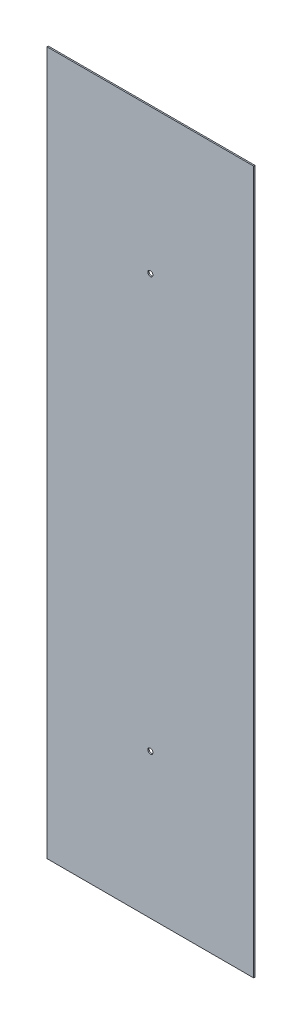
ISO-10303-21;
HEADER;
FILE_DESCRIPTION(('STEP AP214'),'2;1');
FILE_NAME('part.step','',(''),(''),'','','');
FILE_SCHEMA(('AUTOMOTIVE_DESIGN { 1 0 10303 214 1 1 1 1 }'));
ENDSEC;
DATA;
#1=APPLICATION_CONTEXT('core data for automotive mechanical design processes');
#2=APPLICATION_PROTOCOL_DEFINITION('international standard','automotive_design',2000,#1);
#3=PRODUCT_CONTEXT('',#1,'mechanical');
#4=PRODUCT('Part','Part','',(#3));
#5=PRODUCT_RELATED_PRODUCT_CATEGORY('part','',(#4));
#6=PRODUCT_DEFINITION_FORMATION('','',#4);
#7=PRODUCT_DEFINITION_CONTEXT('part definition',#1,'design');
#8=PRODUCT_DEFINITION('design','',#6,#7);
#9=PRODUCT_DEFINITION_SHAPE('','',#8);
#10=(LENGTH_UNIT() NAMED_UNIT(*) SI_UNIT(.MILLI.,.METRE.));
#11=(NAMED_UNIT(*) PLANE_ANGLE_UNIT() SI_UNIT($,.RADIAN.));
#12=(NAMED_UNIT(*) SI_UNIT($,.STERADIAN.) SOLID_ANGLE_UNIT());
#13=UNCERTAINTY_MEASURE_WITH_UNIT(LENGTH_MEASURE(1.E-05),#10,'distance_accuracy_value','');
#14=(GEOMETRIC_REPRESENTATION_CONTEXT(3) GLOBAL_UNCERTAINTY_ASSIGNED_CONTEXT((#13)) GLOBAL_UNIT_ASSIGNED_CONTEXT((#10,
#11,#12)) REPRESENTATION_CONTEXT('',''));
#15=CARTESIAN_POINT('',(0.,0.,0.));
#16=DIRECTION('',(0.,0.,1.));
#17=DIRECTION('',(1.,0.,0.));
#18=AXIS2_PLACEMENT_3D('',#15,#16,#17);
#19=CARTESIAN_POINT('',(0.,0.,3.175));
#20=DIRECTION('',(0.,0.,1.));
#21=DIRECTION('',(1.,0.,0.));
#22=AXIS2_PLACEMENT_3D('',#19,#20,#21);
#23=PLANE('',#22);
#24=CARTESIAN_POINT('',(-2.22044604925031E-13,500.,3.175));
#25=DIRECTION('',(0.,0.,1.));
#26=DIRECTION('',(1.,0.,0.));
#27=AXIS2_PLACEMENT_3D('',#24,#25,#26);
#28=CIRCLE('',#27,6.28023081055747);
#29=CARTESIAN_POINT('',(6.28023081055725,500.,3.175));
#30=VERTEX_POINT('',#29);
#31=EDGE_CURVE('E100',#30,#30,#28,.T.);
#32=ORIENTED_EDGE('',*,*,#31,.F.);
#33=EDGE_LOOP('',(#32));
#34=FACE_BOUND('',#33,.T.);
#35=DIRECTION('',(0.,-1.,0.));
#36=VECTOR('',#35,1.);
#37=CARTESIAN_POINT('',(-250.,-850.,3.175));
#38=LINE('',#37,#36);
#39=CARTESIAN_POINT('',(-250.,850.,3.175));
#40=VERTEX_POINT('',#39);
#41=CARTESIAN_POINT('',(-250.,-850.,3.175));
#42=VERTEX_POINT('',#41);
#43=EDGE_CURVE('E85',#40,#42,#38,.T.);
#44=ORIENTED_EDGE('',*,*,#43,.T.);
#45=DIRECTION('',(1.,0.,0.));
#46=VECTOR('',#45,1.);
#47=CARTESIAN_POINT('',(250.,-850.,3.175));
#48=LINE('',#47,#46);
#49=CARTESIAN_POINT('',(250.,-850.,3.175));
#50=VERTEX_POINT('',#49);
#51=EDGE_CURVE('E80',#42,#50,#48,.T.);
#52=ORIENTED_EDGE('',*,*,#51,.T.);
#53=DIRECTION('',(0.,1.,0.));
#54=VECTOR('',#53,1.);
#55=CARTESIAN_POINT('',(250.,-850.,3.175));
#56=LINE('',#55,#54);
#57=CARTESIAN_POINT('',(250.,850.,3.175));
#58=VERTEX_POINT('',#57);
#59=EDGE_CURVE('E83',#50,#58,#56,.T.);
#60=ORIENTED_EDGE('',*,*,#59,.T.);
#61=DIRECTION('',(-1.,0.,0.));
#62=VECTOR('',#61,1.);
#63=CARTESIAN_POINT('',(250.,850.,3.175));
#64=LINE('',#63,#62);
#65=EDGE_CURVE('E50',#58,#40,#64,.T.);
#66=ORIENTED_EDGE('',*,*,#65,.T.);
#67=EDGE_LOOP('',(#44,#52,#60,#66));
#68=FACE_BOUND('',#67,.T.);
#69=CARTESIAN_POINT('',(0.,-500.,3.175));
#70=DIRECTION('',(0.,0.,1.));
#71=DIRECTION('',(1.,0.,0.));
#72=AXIS2_PLACEMENT_3D('',#69,#70,#71);
#73=CIRCLE('',#72,6.28023081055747);
#74=CARTESIAN_POINT('',(6.28023081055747,-500.,3.175));
#75=VERTEX_POINT('',#74);
#76=EDGE_CURVE('E115',#75,#75,#73,.T.);
#77=ORIENTED_EDGE('',*,*,#76,.F.);
#78=EDGE_LOOP('',(#77));
#79=FACE_BOUND('',#78,.T.);
#80=ADVANCED_FACE('F33',(#34,#68,#79),#23,.T.);
#81=CARTESIAN_POINT('',(0.,0.,0.));
#82=DIRECTION('',(0.,0.,1.));
#83=DIRECTION('',(1.,0.,0.));
#84=AXIS2_PLACEMENT_3D('',#81,#82,#83);
#85=PLANE('',#84);
#86=DIRECTION('',(0.,-1.,0.));
#87=VECTOR('',#86,1.);
#88=CARTESIAN_POINT('',(-250.,-850.,0.));
#89=LINE('',#88,#87);
#90=CARTESIAN_POINT('',(-250.,850.,0.));
#91=VERTEX_POINT('',#90);
#92=CARTESIAN_POINT('',(-250.,-850.,0.));
#93=VERTEX_POINT('',#92);
#94=EDGE_CURVE('E97',#91,#93,#89,.T.);
#95=ORIENTED_EDGE('',*,*,#94,.F.);
#96=DIRECTION('',(-1.,0.,0.));
#97=VECTOR('',#96,1.);
#98=CARTESIAN_POINT('',(250.,850.,0.));
#99=LINE('',#98,#97);
#100=CARTESIAN_POINT('',(250.,850.,0.));
#101=VERTEX_POINT('',#100);
#102=EDGE_CURVE('E73',#101,#91,#99,.T.);
#103=ORIENTED_EDGE('',*,*,#102,.F.);
#104=DIRECTION('',(0.,1.,0.));
#105=VECTOR('',#104,1.);
#106=CARTESIAN_POINT('',(250.,-850.,0.));
#107=LINE('',#106,#105);
#108=CARTESIAN_POINT('',(250.,-850.,0.));
#109=VERTEX_POINT('',#108);
#110=EDGE_CURVE('E67',#109,#101,#107,.T.);
#111=ORIENTED_EDGE('',*,*,#110,.F.);
#112=DIRECTION('',(1.,0.,0.));
#113=VECTOR('',#112,1.);
#114=CARTESIAN_POINT('',(250.,-850.,0.));
#115=LINE('',#114,#113);
#116=EDGE_CURVE('E89',#93,#109,#115,.T.);
#117=ORIENTED_EDGE('',*,*,#116,.F.);
#118=EDGE_LOOP('',(#95,#103,#111,#117));
#119=FACE_BOUND('',#118,.T.);
#120=CARTESIAN_POINT('',(-2.22044604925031E-13,500.,0.));
#121=DIRECTION('',(0.,0.,1.));
#122=DIRECTION('',(1.,0.,0.));
#123=AXIS2_PLACEMENT_3D('',#120,#121,#122);
#124=CIRCLE('',#123,6.28023081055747);
#125=CARTESIAN_POINT('',(6.28023081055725,500.,0.));
#126=VERTEX_POINT('',#125);
#127=EDGE_CURVE('E112',#126,#126,#124,.T.);
#128=ORIENTED_EDGE('',*,*,#127,.T.);
#129=EDGE_LOOP('',(#128));
#130=FACE_BOUND('',#129,.T.);
#131=CARTESIAN_POINT('',(0.,-500.,0.));
#132=DIRECTION('',(0.,0.,1.));
#133=DIRECTION('',(1.,0.,0.));
#134=AXIS2_PLACEMENT_3D('',#131,#132,#133);
#135=CIRCLE('',#134,6.28023081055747);
#136=CARTESIAN_POINT('',(6.28023081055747,-500.,0.));
#137=VERTEX_POINT('',#136);
#138=EDGE_CURVE('E118',#137,#137,#135,.T.);
#139=ORIENTED_EDGE('',*,*,#138,.T.);
#140=EDGE_LOOP('',(#139));
#141=FACE_BOUND('',#140,.T.);
#142=ADVANCED_FACE('F108',(#119,#130,#141),#85,.F.);
#143=CARTESIAN_POINT('',(-250.,-850.,3.175));
#144=DIRECTION('',(1.,0.,0.));
#145=DIRECTION('',(0.,0.,-1.));
#146=AXIS2_PLACEMENT_3D('',#143,#144,#145);
#147=PLANE('',#146);
#148=ORIENTED_EDGE('',*,*,#94,.T.);
#149=DIRECTION('',(0.,0.,-1.));
#150=VECTOR('',#149,1.);
#151=CARTESIAN_POINT('',(-250.,-850.,3.175));
#152=LINE('',#151,#150);
#153=EDGE_CURVE('E11',#42,#93,#152,.T.);
#154=ORIENTED_EDGE('',*,*,#153,.F.);
#155=ORIENTED_EDGE('',*,*,#43,.F.);
#156=DIRECTION('',(0.,0.,-1.));
#157=VECTOR('',#156,1.);
#158=CARTESIAN_POINT('',(-250.,850.,3.175));
#159=LINE('',#158,#157);
#160=EDGE_CURVE('E93',#40,#91,#159,.T.);
#161=ORIENTED_EDGE('',*,*,#160,.T.);
#162=EDGE_LOOP('',(#148,#154,#155,#161));
#163=FACE_BOUND('',#162,.T.);
#164=ADVANCED_FACE('F35',(#163),#147,.F.);
#165=CARTESIAN_POINT('',(250.,-850.,3.175));
#166=DIRECTION('',(0.,1.,0.));
#167=DIRECTION('',(0.,0.,1.));
#168=AXIS2_PLACEMENT_3D('',#165,#166,#167);
#169=PLANE('',#168);
#170=ORIENTED_EDGE('',*,*,#116,.T.);
#171=DIRECTION('',(0.,0.,-1.));
#172=VECTOR('',#171,1.);
#173=CARTESIAN_POINT('',(250.,-850.,3.175));
#174=LINE('',#173,#172);
#175=EDGE_CURVE('E42',#50,#109,#174,.T.);
#176=ORIENTED_EDGE('',*,*,#175,.F.);
#177=ORIENTED_EDGE('',*,*,#51,.F.);
#178=ORIENTED_EDGE('',*,*,#153,.T.);
#179=EDGE_LOOP('',(#170,#176,#177,#178));
#180=FACE_BOUND('',#179,.T.);
#181=ADVANCED_FACE('F88',(#180),#169,.F.);
#182=CARTESIAN_POINT('',(250.,-850.,3.175));
#183=DIRECTION('',(-1.,0.,0.));
#184=DIRECTION('',(0.,0.,1.));
#185=AXIS2_PLACEMENT_3D('',#182,#183,#184);
#186=PLANE('',#185);
#187=ORIENTED_EDGE('',*,*,#110,.T.);
#188=DIRECTION('',(0.,0.,-1.));
#189=VECTOR('',#188,1.);
#190=CARTESIAN_POINT('',(250.,850.,3.175));
#191=LINE('',#190,#189);
#192=EDGE_CURVE('E90',#58,#101,#191,.T.);
#193=ORIENTED_EDGE('',*,*,#192,.F.);
#194=ORIENTED_EDGE('',*,*,#59,.F.);
#195=ORIENTED_EDGE('',*,*,#175,.T.);
#196=EDGE_LOOP('',(#187,#193,#194,#195));
#197=FACE_BOUND('',#196,.T.);
#198=ADVANCED_FACE('F91',(#197),#186,.F.);
#199=CARTESIAN_POINT('',(250.,850.,3.175));
#200=DIRECTION('',(0.,-1.,0.));
#201=DIRECTION('',(0.,0.,-1.));
#202=AXIS2_PLACEMENT_3D('',#199,#200,#201);
#203=PLANE('',#202);
#204=ORIENTED_EDGE('',*,*,#102,.T.);
#205=ORIENTED_EDGE('',*,*,#160,.F.);
#206=ORIENTED_EDGE('',*,*,#65,.F.);
#207=ORIENTED_EDGE('',*,*,#192,.T.);
#208=EDGE_LOOP('',(#204,#205,#206,#207));
#209=FACE_BOUND('',#208,.T.);
#210=ADVANCED_FACE('F105',(#209),#203,.F.);
#211=CARTESIAN_POINT('',(-2.22044604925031E-13,500.,3.175));
#212=DIRECTION('',(0.,0.,-1.));
#213=DIRECTION('',(-1.,0.,0.));
#214=AXIS2_PLACEMENT_3D('',#211,#212,#213);
#215=CYLINDRICAL_SURFACE('',#214,6.28023081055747);
#216=ORIENTED_EDGE('',*,*,#31,.T.);
#217=EDGE_LOOP('',(#216));
#218=FACE_BOUND('',#217,.T.);
#219=ORIENTED_EDGE('',*,*,#127,.F.);
#220=EDGE_LOOP('',(#219));
#221=FACE_BOUND('',#220,.T.);
#222=ADVANCED_FACE('F135',(#218,#221),#215,.F.);
#223=CARTESIAN_POINT('',(0.,-500.,3.175));
#224=DIRECTION('',(0.,0.,-1.));
#225=DIRECTION('',(-1.,0.,0.));
#226=AXIS2_PLACEMENT_3D('',#223,#224,#225);
#227=CYLINDRICAL_SURFACE('',#226,6.28023081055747);
#228=ORIENTED_EDGE('',*,*,#76,.T.);
#229=EDGE_LOOP('',(#228));
#230=FACE_BOUND('',#229,.T.);
#231=ORIENTED_EDGE('',*,*,#138,.F.);
#232=EDGE_LOOP('',(#231));
#233=FACE_BOUND('',#232,.T.);
#234=ADVANCED_FACE('F124',(#230,#233),#227,.F.);
#235=CLOSED_SHELL('',(#80,#142,#164,#181,#198,#210,#222,#234));
#236=MANIFOLD_SOLID_BREP('B2',#235);
#237=ADVANCED_BREP_SHAPE_REPRESENTATION('',(#18,#236),#14);
#238=SHAPE_DEFINITION_REPRESENTATION(#9,#237);
ENDSEC;
END-ISO-10303-21;
